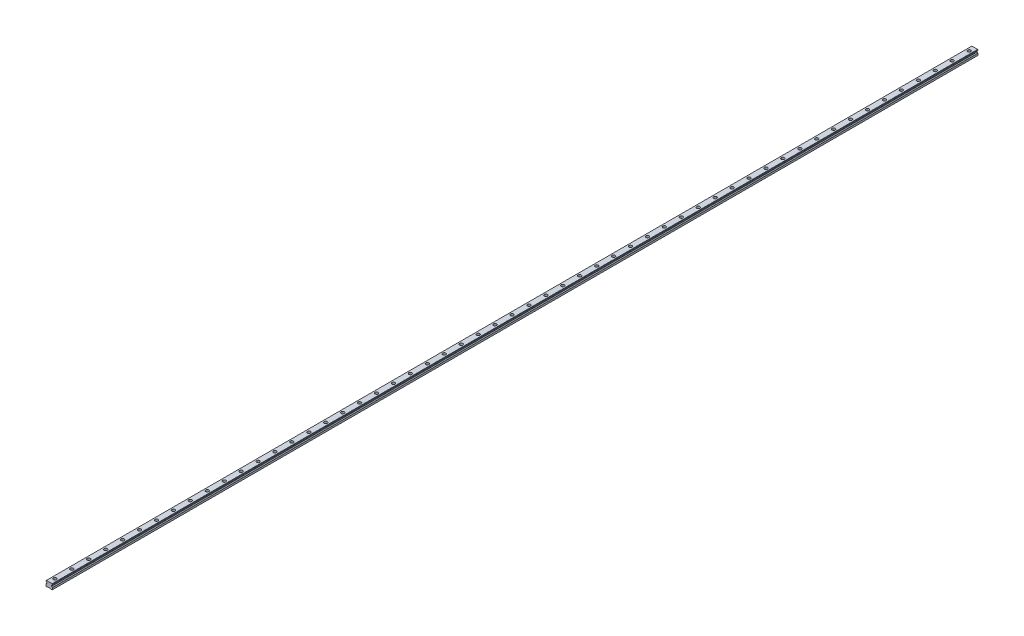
from build123d import *

# Parameters (mm, degrees)
SKETCH1_W           = 23
SKETCH1_H           = 19.2
BOSS_EXTRUDE1_DEPTH = 1640
CUT_EXTRUDE1_DEPTH  = 3281.076354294
CHAMFER1_SIZE       = 1.25
FILLET1_R           = 1.25
CUT_EXTRUDE2_DEPTH  = 3281.076354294
SKETCH4_R           = 5.5
SKETCH4_R_2         = 3.5
CUT_EXTRUDE3_DEPTH  = 9
SKETCH4_2_R         = 3.5
CUT_EXTRUDE4_DEPTH  = 1641.152703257
LPATTERN1_COUNT     = 55
LPATTERN1_PITCH     = 60


with BuildPart() as part:
    # Sketch1 → Boss-Extrude1 (new, symmetric)
    with BuildSketch(Plane.XY):
        with Locations((0, 9.6)):
            Rectangle(SKETCH1_W, SKETCH1_H)
    extrude(amount=BOSS_EXTRUDE1_DEPTH, both=True)

    # Sketch2 → Cut-Extrude1 (cut, through all)
    with BuildSketch(Plane.XY.offset(1640)):
        Polygon((-11.5, 16.7), (-11.5, 7.95), (-8.583333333, 10.866666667), (-8.583333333, 13.783333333), align=None)
        Polygon((8.583333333, 13.783333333), (11.5, 16.7), (11.5, 7.95), (8.583333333, 10.866666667), align=None)
    extrude(amount=-CUT_EXTRUDE1_DEPTH, mode=Mode.SUBTRACT)

    # Chamfer1
    chamfer1_edges = [part.edges().sort_by_distance(p)[0] for p in [
        (-11.5, 19.2, 0),
        (11.5, 19.2, 0),
        (11.5, 0, 0),
        (-11.5, 0, 0),
    ]]
    chamfer(chamfer1_edges, length=CHAMFER1_SIZE)

    # Fillet1
    fillet1_edges = [part.edges().sort_by_distance(p)[0] for p in [
        (-8.583333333, 13.783333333, 0),
        (-8.583333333, 10.866666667, 0),
        (8.583333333, 10.866666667, 0),
        (8.583333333, 13.783333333, 0),
    ]]
    fillet(fillet1_edges, radius=FILLET1_R)

    # Sketch3 → Cut-Extrude2 (cut, through all)
    with BuildSketch(Plane.XY.offset(1640)):
        Polygon((-7, 0), (-5.75, 1.25), (5.75, 1.25), (7, 0), align=None)
    extrude(amount=-CUT_EXTRUDE2_DEPTH, mode=Mode.SUBTRACT)

    # Sketch4 → Cut-Extrude3 (cut)
    with BuildSketch(Plane(origin=(0, 19.2, 0), x_dir=(1, 0, 0), z_dir=(0, 1, 0))):
        with Locations(Location((0, -1620, 0), (0, 0, 270))):
            Circle(SKETCH4_R)
        with Locations(Location((0, -1620, 0), (0, 0, 270))):
            Circle(SKETCH4_R_2, mode=Mode.SUBTRACT)
    cut_extrude3 = extrude(amount=-CUT_EXTRUDE3_DEPTH, mode=Mode.SUBTRACT)

    # Sketch4_2 → Cut-Extrude4 (cut, through all)
    with BuildSketch(Plane(origin=(0, 19.2, 0), x_dir=(1, 0, 0), z_dir=(0, 1, 0))):
        with Locations(Location((0, -1620, 0), (0, 0, 270))):
            Circle(SKETCH4_2_R)
    cut_extrude4 = extrude(amount=-CUT_EXTRUDE4_DEPTH, mode=Mode.SUBTRACT)

    # LPattern1: Cut-Extrude3, Cut-Extrude4 ×55
    with Locations(*[(0, 0, -i * LPATTERN1_PITCH) for i in range(1, LPATTERN1_COUNT)]):
        add(cut_extrude3, mode=Mode.SUBTRACT)
        add(cut_extrude4, mode=Mode.SUBTRACT)


solid = part.part
